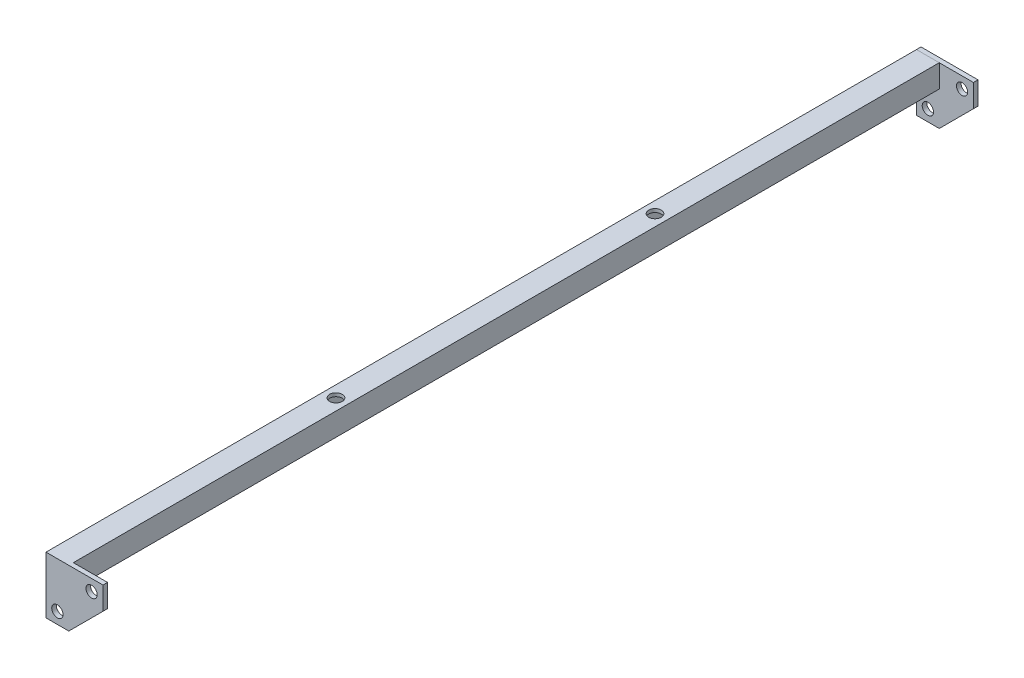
from build123d import *

# Parameters (mm, degrees)
ESQUISSE1_R             = 4.973149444
ESQUISSE1_R_2           = 4.903594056
EXTRUSION1_DEPTH        = 4
EXTRUSION3_START        = 4
ESQUISSE3_R             = 4.903594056
ESQUISSE3_R_2           = 4.973149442
EXTRUSION3_DEPTH        = 4
ESQUISSE2_W             = 20
ESQUISSE2_H             = 20
ESQUISSE2_W_2           = 14
ESQUISSE2_H_2           = 14
EXTRUSION4_DEPTH        = 760
ESQUISSE5_R             = 5.5
ENL_V_MAT_EXTRU_1_DEPTH = 772.248338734


with BuildPart() as part:
    # Esquisse1 → Extrusion1 (new body)
    with BuildSketch(Plane.XY):
        Polygon((0, 770), (0, 720), (20, 720), (50, 750), (50, 770), align=None)
        with Locations((10, 730)):
            Circle(ESQUISSE1_R, mode=Mode.SUBTRACT)
        with Locations((40, 760)):
            Circle(ESQUISSE1_R_2, mode=Mode.SUBTRACT)
    extrude(amount=EXTRUSION1_DEPTH)


with BuildPart() as body_2:
    # Esquisse3 → Extrusion3 (new body)
    with BuildSketch(Plane(origin=(0, 0, 768), x_dir=(-1, 0, 0), z_dir=(0, 0, -1)).offset(EXTRUSION3_START)):
        Polygon((0, 770), (0, 720), (-20, 720), (-50, 750), (-50, 770), align=None)
        with Locations((-40, 760)):
            Circle(ESQUISSE3_R, mode=Mode.SUBTRACT)
        with Locations((-10, 730)):
            Circle(ESQUISSE3_R_2, mode=Mode.SUBTRACT)
    extrude(amount=-EXTRUSION3_DEPTH)

    # Esquisse2 → Extrusion4 (add)
    with BuildSketch(Plane.XY.offset(4)):
        with Locations((10, 760)):
            Rectangle(ESQUISSE2_W, ESQUISSE2_H)
        with Locations((10, 760)):
            Rectangle(ESQUISSE2_W_2, ESQUISSE2_H_2, mode=Mode.SUBTRACT)
    extrude(amount=EXTRUSION4_DEPTH)

    # Esquisse5 → Enl_v. mat.-Extru.1 (cut, through all)
    with BuildSketch(Plane(origin=(0, 770, 0), x_dir=(-1, 0, 0), z_dir=(0, 1, 0))):
        with Locations(Location((-10, 243.5, 0), (0, 0, 90))):
            Circle(ESQUISSE5_R)
        with Locations(Location((-10, 523.5, 0), (0, 0, 90))):
            Circle(ESQUISSE5_R)
    extrude(amount=-ENL_V_MAT_EXTRU_1_DEPTH, mode=Mode.SUBTRACT)


solid = Compound([part.part, body_2.part])
